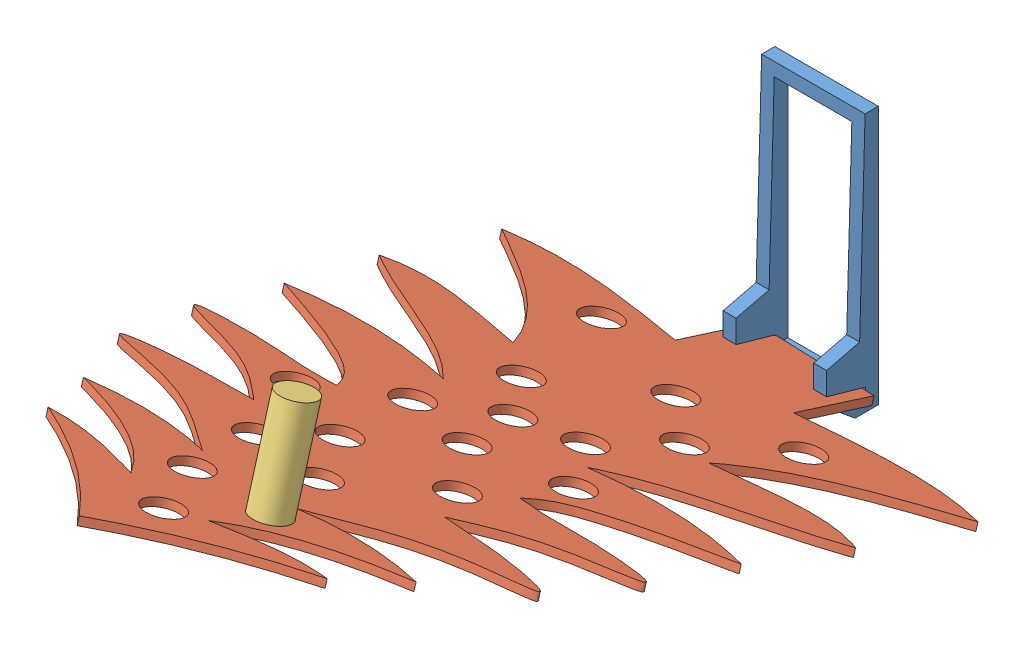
SolidWorks assembly Assemblage1.SLDASM, configuration Défaut (file format 10000). Lengths in mm.
Overall size (205.31 109.53 281.91).
4 component instances, 4 part files, 5 mates.
Components (placement in the parent):
- SUP-1: SUP.SLDPRT [Défaut] at (6.6486 -55.4099 100) size (40 100 20)
- SAPIN-1: SAPIN.SLDPRT [Défaut] at (-109.9382 -53.1217 95.4378) x (0.99898 0.012317 0.043434) z (0 -0.962062 0.272832) size (192.75 282.72 3)
- EMBOUT-1: EMBOUT.SLDPRT [Défaut] at (-1.1383 51.2541 314.6791) x (-0.791947 -0.166588 -0.587426) z (-0.61059 0.216068 0.761902) size (15 41.6 15)
- BOUCHON-1: BOUCHON.SLDPRT [Défaut] at (-1.1383 13.4345 325.4044) x (-0.849291 -0.144035 -0.507897) z (-0.527926 0.231713 0.81707) size (12.5 3.29 12.5)
Mates (geometry in assembly coordinates):
- Coïncidente1: coincident anti-aligned: plane of SUP-1 through (-31.0215 -46.1561 120) normal (0 0.962062 -0.272832); plane of SAPIN-1 through (4.0807 20.865 356.3305) normal (0 -0.962062 0.272832)
- Coaxiale1: concentric anti-aligned: cylinder of SAPIN-1 through (-1.1383 15.0806 324.9376) axis (0 -0.962062 0.272832) radius 7; cylinder of EMBOUT-1 through (-1.1383 51.2541 314.6791) axis (0 0.962062 -0.272832) radius 6.9
- Coïncidente2: coincident anti-aligned: plane of SAPIN-1 through (4.0807 20.865 356.3305) normal (0 -0.962062 0.272832); circle of EMBOUT-1
- Coaxiale2: concentric aligned: cylinder of EMBOUT-1 through (-1.1383 51.2541 314.6791) axis (0 0.962062 -0.272832) radius 6; cylinder of BOUCHON-1 through (-1.1383 13.4345 325.4044) axis (0 0.962062 -0.272832) radius 5.75
- Coïncidente3: coincident anti-aligned: plane of EMBOUT-1 through (4.8013 12.4817 330.4346) normal (0 -0.962062 0.272832); circle of BOUCHON-1
